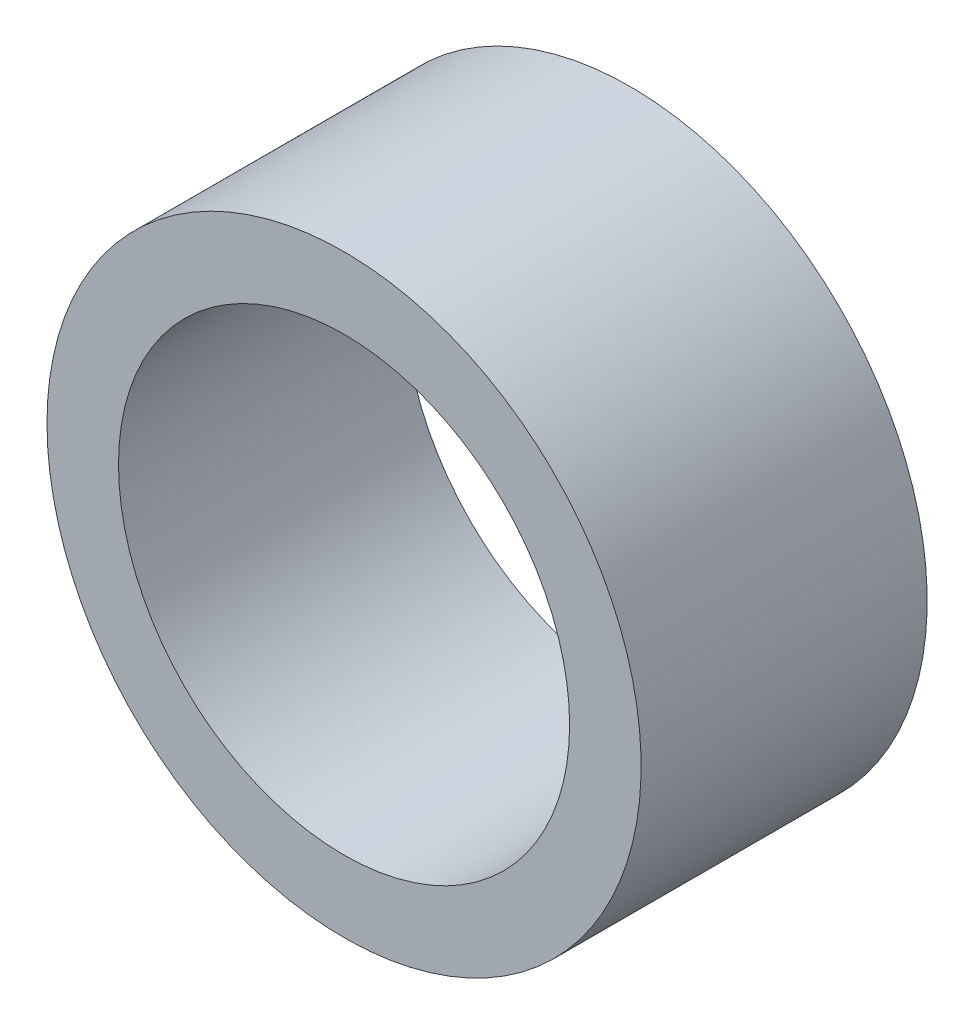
ISO-10303-21;
HEADER;
FILE_DESCRIPTION(('STEP AP214'),'2;1');
FILE_NAME('part.step','',(''),(''),'','','');
FILE_SCHEMA(('AUTOMOTIVE_DESIGN { 1 0 10303 214 1 1 1 1 }'));
ENDSEC;
DATA;
#1=APPLICATION_CONTEXT('core data for automotive mechanical design processes');
#2=APPLICATION_PROTOCOL_DEFINITION('international standard','automotive_design',2000,#1);
#3=PRODUCT_CONTEXT('',#1,'mechanical');
#4=PRODUCT('Part','Part','',(#3));
#5=PRODUCT_RELATED_PRODUCT_CATEGORY('part','',(#4));
#6=PRODUCT_DEFINITION_FORMATION('','',#4);
#7=PRODUCT_DEFINITION_CONTEXT('part definition',#1,'design');
#8=PRODUCT_DEFINITION('design','',#6,#7);
#9=PRODUCT_DEFINITION_SHAPE('','',#8);
#10=(LENGTH_UNIT() NAMED_UNIT(*) SI_UNIT(.MILLI.,.METRE.));
#11=(NAMED_UNIT(*) PLANE_ANGLE_UNIT() SI_UNIT($,.RADIAN.));
#12=(NAMED_UNIT(*) SI_UNIT($,.STERADIAN.) SOLID_ANGLE_UNIT());
#13=UNCERTAINTY_MEASURE_WITH_UNIT(LENGTH_MEASURE(1.E-05),#10,'distance_accuracy_value','');
#14=(GEOMETRIC_REPRESENTATION_CONTEXT(3) GLOBAL_UNCERTAINTY_ASSIGNED_CONTEXT((#13)) GLOBAL_UNIT_ASSIGNED_CONTEXT((#10,
#11,#12)) REPRESENTATION_CONTEXT('',''));
#15=CARTESIAN_POINT('',(0.,0.,0.));
#16=DIRECTION('',(0.,0.,1.));
#17=DIRECTION('',(1.,0.,0.));
#18=AXIS2_PLACEMENT_3D('',#15,#16,#17);
#19=CARTESIAN_POINT('',(0.,0.,13.));
#20=DIRECTION('',(0.,0.,1.));
#21=DIRECTION('',(1.,0.,0.));
#22=AXIS2_PLACEMENT_3D('',#19,#20,#21);
#23=PLANE('',#22);
#24=CARTESIAN_POINT('',(0.,0.,13.));
#25=DIRECTION('',(0.,0.,1.));
#26=DIRECTION('',(1.,0.,0.));
#27=AXIS2_PLACEMENT_3D('',#24,#25,#26);
#28=CIRCLE('',#27,13.5);
#29=CARTESIAN_POINT('',(-13.5,0.,13.));
#30=VERTEX_POINT('',#29);
#31=EDGE_CURVE('E12',#30,#30,#28,.T.);
#32=ORIENTED_EDGE('',*,*,#31,.T.);
#33=EDGE_LOOP('',(#32));
#34=FACE_BOUND('',#33,.T.);
#35=CARTESIAN_POINT('',(0.,0.,13.));
#36=DIRECTION('',(0.,0.,1.));
#37=DIRECTION('',(1.,0.,0.));
#38=AXIS2_PLACEMENT_3D('',#35,#36,#37);
#39=CIRCLE('',#38,10.25);
#40=CARTESIAN_POINT('',(-10.25,0.,13.));
#41=VERTEX_POINT('',#40);
#42=EDGE_CURVE('E50',#41,#41,#39,.T.);
#43=ORIENTED_EDGE('',*,*,#42,.F.);
#44=EDGE_LOOP('',(#43));
#45=FACE_BOUND('',#44,.T.);
#46=ADVANCED_FACE('F39',(#34,#45),#23,.T.);
#47=CARTESIAN_POINT('',(0.,0.,0.));
#48=DIRECTION('',(0.,0.,1.));
#49=DIRECTION('',(1.,0.,0.));
#50=AXIS2_PLACEMENT_3D('',#47,#48,#49);
#51=PLANE('',#50);
#52=CARTESIAN_POINT('',(0.,0.,0.));
#53=DIRECTION('',(0.,0.,1.));
#54=DIRECTION('',(1.,0.,0.));
#55=AXIS2_PLACEMENT_3D('',#52,#53,#54);
#56=CIRCLE('',#55,13.5);
#57=CARTESIAN_POINT('',(-13.5,0.,0.));
#58=VERTEX_POINT('',#57);
#59=EDGE_CURVE('E46',#58,#58,#56,.T.);
#60=ORIENTED_EDGE('',*,*,#59,.F.);
#61=EDGE_LOOP('',(#60));
#62=FACE_BOUND('',#61,.T.);
#63=CARTESIAN_POINT('',(0.,0.,0.));
#64=DIRECTION('',(0.,0.,1.));
#65=DIRECTION('',(1.,0.,0.));
#66=AXIS2_PLACEMENT_3D('',#63,#64,#65);
#67=CIRCLE('',#66,10.25);
#68=CARTESIAN_POINT('',(-10.25,0.,0.));
#69=VERTEX_POINT('',#68);
#70=EDGE_CURVE('E54',#69,#69,#67,.T.);
#71=ORIENTED_EDGE('',*,*,#70,.T.);
#72=EDGE_LOOP('',(#71));
#73=FACE_BOUND('',#72,.T.);
#74=ADVANCED_FACE('F60',(#62,#73),#51,.F.);
#75=CARTESIAN_POINT('',(0.,0.,13.));
#76=DIRECTION('',(0.,0.,-1.));
#77=DIRECTION('',(-1.,0.,0.));
#78=AXIS2_PLACEMENT_3D('',#75,#76,#77);
#79=CYLINDRICAL_SURFACE('',#78,13.5);
#80=CARTESIAN_POINT('',(-13.5,0.,13.));
#81=CARTESIAN_POINT('',(-13.5,0.,12.8645833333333));
#82=CARTESIAN_POINT('',(-13.5,0.,12.7291666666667));
#83=CARTESIAN_POINT('',(-13.5,0.,12.4583333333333));
#84=CARTESIAN_POINT('',(-13.5,0.,12.3229166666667));
#85=CARTESIAN_POINT('',(-13.5,0.,12.0520833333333));
#86=CARTESIAN_POINT('',(-13.5,0.,11.9166666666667));
#87=CARTESIAN_POINT('',(-13.5,0.,11.6458333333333));
#88=CARTESIAN_POINT('',(-13.5,0.,11.5104166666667));
#89=CARTESIAN_POINT('',(-13.5,0.,11.2395833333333));
#90=CARTESIAN_POINT('',(-13.5,0.,11.1041666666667));
#91=CARTESIAN_POINT('',(-13.5,0.,10.8333333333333));
#92=CARTESIAN_POINT('',(-13.5,0.,10.6979166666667));
#93=CARTESIAN_POINT('',(-13.5,0.,10.4270833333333));
#94=CARTESIAN_POINT('',(-13.5,0.,10.2916666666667));
#95=CARTESIAN_POINT('',(-13.5,0.,10.0208333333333));
#96=CARTESIAN_POINT('',(-13.5,0.,9.88541666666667));
#97=CARTESIAN_POINT('',(-13.5,0.,9.61458333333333));
#98=CARTESIAN_POINT('',(-13.5,0.,9.47916666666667));
#99=CARTESIAN_POINT('',(-13.5,0.,9.20833333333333));
#100=CARTESIAN_POINT('',(-13.5,0.,9.07291666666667));
#101=CARTESIAN_POINT('',(-13.5,0.,8.80208333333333));
#102=CARTESIAN_POINT('',(-13.5,0.,8.66666666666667));
#103=CARTESIAN_POINT('',(-13.5,0.,8.39583333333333));
#104=CARTESIAN_POINT('',(-13.5,0.,8.26041666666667));
#105=CARTESIAN_POINT('',(-13.5,0.,7.98958333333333));
#106=CARTESIAN_POINT('',(-13.5,0.,7.85416666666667));
#107=CARTESIAN_POINT('',(-13.5,0.,7.58333333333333));
#108=CARTESIAN_POINT('',(-13.5,0.,7.44791666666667));
#109=CARTESIAN_POINT('',(-13.5,0.,7.17708333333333));
#110=CARTESIAN_POINT('',(-13.5,0.,7.04166666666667));
#111=CARTESIAN_POINT('',(-13.5,0.,6.77083333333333));
#112=CARTESIAN_POINT('',(-13.5,0.,6.63541666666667));
#113=CARTESIAN_POINT('',(-13.5,0.,6.36458333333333));
#114=CARTESIAN_POINT('',(-13.5,0.,6.22916666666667));
#115=CARTESIAN_POINT('',(-13.5,0.,5.95833333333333));
#116=CARTESIAN_POINT('',(-13.5,0.,5.82291666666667));
#117=CARTESIAN_POINT('',(-13.5,0.,5.55208333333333));
#118=CARTESIAN_POINT('',(-13.5,0.,5.41666666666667));
#119=CARTESIAN_POINT('',(-13.5,0.,5.14583333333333));
#120=CARTESIAN_POINT('',(-13.5,0.,5.01041666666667));
#121=CARTESIAN_POINT('',(-13.5,0.,4.73958333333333));
#122=CARTESIAN_POINT('',(-13.5,0.,4.60416666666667));
#123=CARTESIAN_POINT('',(-13.5,0.,4.33333333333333));
#124=CARTESIAN_POINT('',(-13.5,0.,4.19791666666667));
#125=CARTESIAN_POINT('',(-13.5,0.,3.92708333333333));
#126=CARTESIAN_POINT('',(-13.5,0.,3.79166666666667));
#127=CARTESIAN_POINT('',(-13.5,0.,3.52083333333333));
#128=CARTESIAN_POINT('',(-13.5,0.,3.38541666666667));
#129=CARTESIAN_POINT('',(-13.5,0.,3.11458333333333));
#130=CARTESIAN_POINT('',(-13.5,0.,2.97916666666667));
#131=CARTESIAN_POINT('',(-13.5,0.,2.70833333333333));
#132=CARTESIAN_POINT('',(-13.5,0.,2.57291666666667));
#133=CARTESIAN_POINT('',(-13.5,0.,2.30208333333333));
#134=CARTESIAN_POINT('',(-13.5,0.,2.16666666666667));
#135=CARTESIAN_POINT('',(-13.5,0.,1.89583333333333));
#136=CARTESIAN_POINT('',(-13.5,0.,1.76041666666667));
#137=CARTESIAN_POINT('',(-13.5,0.,1.48958333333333));
#138=CARTESIAN_POINT('',(-13.5,0.,1.35416666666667));
#139=CARTESIAN_POINT('',(-13.5,0.,1.08333333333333));
#140=CARTESIAN_POINT('',(-13.5,0.,0.947916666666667));
#141=CARTESIAN_POINT('',(-13.5,0.,0.677083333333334));
#142=CARTESIAN_POINT('',(-13.5,0.,0.541666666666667));
#143=CARTESIAN_POINT('',(-13.5,0.,0.270833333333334));
#144=CARTESIAN_POINT('',(-13.5,0.,0.135416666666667));
#145=CARTESIAN_POINT('',(-13.5,0.,0.));
#146=B_SPLINE_CURVE_WITH_KNOTS('',3,(#80,#81,#82,#83,#84,#85,#86,#87,#88,#89,#90,#91,#92,#93,
#94,#95,#96,#97,#98,#99,#100,#101,#102,#103,#104,#105,#106,#107,#108,#109,#110,#111,#112,#113,
#114,#115,#116,#117,#118,#119,#120,#121,#122,#123,#124,#125,#126,#127,#128,#129,#130,#131,#132,
#133,#134,#135,#136,#137,#138,#139,#140,#141,#142,#143,#144,#145),.UNSPECIFIED.,.F.,.F.,(4,2,2,
2,2,2,2,2,2,2,2,2,2,2,2,2,2,2,2,2,2,2,2,2,2,2,2,2,2,2,2,2,4),(0.,0.406249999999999,
0.812499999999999,1.21875,1.625,2.03125,2.4375,2.84375,3.25,3.65625,4.0625,4.46875,4.875,
5.28125,5.6875,6.09375,6.5,6.90625,7.3125,7.71875,8.125,8.53125,8.9375,9.34375,9.75,10.15625,
10.5625,10.96875,11.375,11.78125,12.1875,12.59375,13.),.UNSPECIFIED.);
#147=EDGE_CURVE('BSEAM41',#30,#58,#146,.T.);
#148=ORIENTED_EDGE('',*,*,#31,.F.);
#149=ORIENTED_EDGE('',*,*,#59,.T.);
#150=ORIENTED_EDGE('',*,*,#147,.T.);
#151=ORIENTED_EDGE('',*,*,#147,.F.);
#152=EDGE_LOOP('',(#148,#150,#149,#151));
#153=FACE_BOUND('',#152,.T.);
#154=ADVANCED_FACE('F41',(#153),#79,.T.);
#155=CARTESIAN_POINT('',(0.,0.,13.));
#156=DIRECTION('',(0.,0.,-1.));
#157=DIRECTION('',(-1.,0.,0.));
#158=AXIS2_PLACEMENT_3D('',#155,#156,#157);
#159=CYLINDRICAL_SURFACE('',#158,10.25);
#160=CARTESIAN_POINT('',(-10.25,0.,13.));
#161=CARTESIAN_POINT('',(-10.25,0.,12.8645833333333));
#162=CARTESIAN_POINT('',(-10.25,0.,12.7291666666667));
#163=CARTESIAN_POINT('',(-10.25,0.,12.4583333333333));
#164=CARTESIAN_POINT('',(-10.25,0.,12.3229166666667));
#165=CARTESIAN_POINT('',(-10.25,0.,12.0520833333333));
#166=CARTESIAN_POINT('',(-10.25,0.,11.9166666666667));
#167=CARTESIAN_POINT('',(-10.25,0.,11.6458333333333));
#168=CARTESIAN_POINT('',(-10.25,0.,11.5104166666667));
#169=CARTESIAN_POINT('',(-10.25,0.,11.2395833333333));
#170=CARTESIAN_POINT('',(-10.25,0.,11.1041666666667));
#171=CARTESIAN_POINT('',(-10.25,0.,10.8333333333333));
#172=CARTESIAN_POINT('',(-10.25,0.,10.6979166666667));
#173=CARTESIAN_POINT('',(-10.25,0.,10.4270833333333));
#174=CARTESIAN_POINT('',(-10.25,0.,10.2916666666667));
#175=CARTESIAN_POINT('',(-10.25,0.,10.0208333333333));
#176=CARTESIAN_POINT('',(-10.25,0.,9.88541666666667));
#177=CARTESIAN_POINT('',(-10.25,0.,9.61458333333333));
#178=CARTESIAN_POINT('',(-10.25,0.,9.47916666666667));
#179=CARTESIAN_POINT('',(-10.25,0.,9.20833333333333));
#180=CARTESIAN_POINT('',(-10.25,0.,9.07291666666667));
#181=CARTESIAN_POINT('',(-10.25,0.,8.80208333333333));
#182=CARTESIAN_POINT('',(-10.25,0.,8.66666666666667));
#183=CARTESIAN_POINT('',(-10.25,0.,8.39583333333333));
#184=CARTESIAN_POINT('',(-10.25,0.,8.26041666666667));
#185=CARTESIAN_POINT('',(-10.25,0.,7.98958333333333));
#186=CARTESIAN_POINT('',(-10.25,0.,7.85416666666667));
#187=CARTESIAN_POINT('',(-10.25,0.,7.58333333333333));
#188=CARTESIAN_POINT('',(-10.25,0.,7.44791666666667));
#189=CARTESIAN_POINT('',(-10.25,0.,7.17708333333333));
#190=CARTESIAN_POINT('',(-10.25,0.,7.04166666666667));
#191=CARTESIAN_POINT('',(-10.25,0.,6.77083333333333));
#192=CARTESIAN_POINT('',(-10.25,0.,6.63541666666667));
#193=CARTESIAN_POINT('',(-10.25,0.,6.36458333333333));
#194=CARTESIAN_POINT('',(-10.25,0.,6.22916666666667));
#195=CARTESIAN_POINT('',(-10.25,0.,5.95833333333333));
#196=CARTESIAN_POINT('',(-10.25,0.,5.82291666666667));
#197=CARTESIAN_POINT('',(-10.25,0.,5.55208333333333));
#198=CARTESIAN_POINT('',(-10.25,0.,5.41666666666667));
#199=CARTESIAN_POINT('',(-10.25,0.,5.14583333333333));
#200=CARTESIAN_POINT('',(-10.25,0.,5.01041666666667));
#201=CARTESIAN_POINT('',(-10.25,0.,4.73958333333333));
#202=CARTESIAN_POINT('',(-10.25,0.,4.60416666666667));
#203=CARTESIAN_POINT('',(-10.25,0.,4.33333333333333));
#204=CARTESIAN_POINT('',(-10.25,0.,4.19791666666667));
#205=CARTESIAN_POINT('',(-10.25,0.,3.92708333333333));
#206=CARTESIAN_POINT('',(-10.25,0.,3.79166666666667));
#207=CARTESIAN_POINT('',(-10.25,0.,3.52083333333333));
#208=CARTESIAN_POINT('',(-10.25,0.,3.38541666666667));
#209=CARTESIAN_POINT('',(-10.25,0.,3.11458333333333));
#210=CARTESIAN_POINT('',(-10.25,0.,2.97916666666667));
#211=CARTESIAN_POINT('',(-10.25,0.,2.70833333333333));
#212=CARTESIAN_POINT('',(-10.25,0.,2.57291666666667));
#213=CARTESIAN_POINT('',(-10.25,0.,2.30208333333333));
#214=CARTESIAN_POINT('',(-10.25,0.,2.16666666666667));
#215=CARTESIAN_POINT('',(-10.25,0.,1.89583333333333));
#216=CARTESIAN_POINT('',(-10.25,0.,1.76041666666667));
#217=CARTESIAN_POINT('',(-10.25,0.,1.48958333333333));
#218=CARTESIAN_POINT('',(-10.25,0.,1.35416666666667));
#219=CARTESIAN_POINT('',(-10.25,0.,1.08333333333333));
#220=CARTESIAN_POINT('',(-10.25,0.,0.947916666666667));
#221=CARTESIAN_POINT('',(-10.25,0.,0.677083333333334));
#222=CARTESIAN_POINT('',(-10.25,0.,0.541666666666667));
#223=CARTESIAN_POINT('',(-10.25,0.,0.270833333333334));
#224=CARTESIAN_POINT('',(-10.25,0.,0.135416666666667));
#225=CARTESIAN_POINT('',(-10.25,0.,0.));
#226=B_SPLINE_CURVE_WITH_KNOTS('',3,(#160,#161,#162,#163,#164,#165,#166,#167,#168,#169,#170,
#171,#172,#173,#174,#175,#176,#177,#178,#179,#180,#181,#182,#183,#184,#185,#186,#187,#188,#189,
#190,#191,#192,#193,#194,#195,#196,#197,#198,#199,#200,#201,#202,#203,#204,#205,#206,#207,#208,
#209,#210,#211,#212,#213,#214,#215,#216,#217,#218,#219,#220,#221,#222,#223,#224,#225),
.UNSPECIFIED.,.F.,.F.,(4,2,2,2,2,2,2,2,2,2,2,2,2,2,2,2,2,2,2,2,2,2,2,2,2,2,2,2,2,2,2,2,4),(0.,
0.406249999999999,0.812499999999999,1.21875,1.625,2.03125,2.4375,2.84375,3.25,3.65625,4.0625,
4.46875,4.875,5.28125,5.6875,6.09375,6.5,6.90625,7.3125,7.71875,8.125,8.53125,8.9375,9.34375,
9.75,10.15625,10.5625,10.96875,11.375,11.78125,12.1875,12.59375,13.),.UNSPECIFIED.);
#227=EDGE_CURVE('BSEAM62',#41,#69,#226,.T.);
#228=ORIENTED_EDGE('',*,*,#42,.T.);
#229=ORIENTED_EDGE('',*,*,#70,.F.);
#230=ORIENTED_EDGE('',*,*,#227,.T.);
#231=ORIENTED_EDGE('',*,*,#227,.F.);
#232=EDGE_LOOP('',(#228,#230,#229,#231));
#233=FACE_BOUND('',#232,.T.);
#234=ADVANCED_FACE('F62',(#233),#159,.F.);
#235=CLOSED_SHELL('',(#46,#74,#154,#234));
#236=MANIFOLD_SOLID_BREP('B2',#235);
#237=ADVANCED_BREP_SHAPE_REPRESENTATION('',(#18,#236),#14);
#238=SHAPE_DEFINITION_REPRESENTATION(#9,#237);
ENDSEC;
END-ISO-10303-21;
